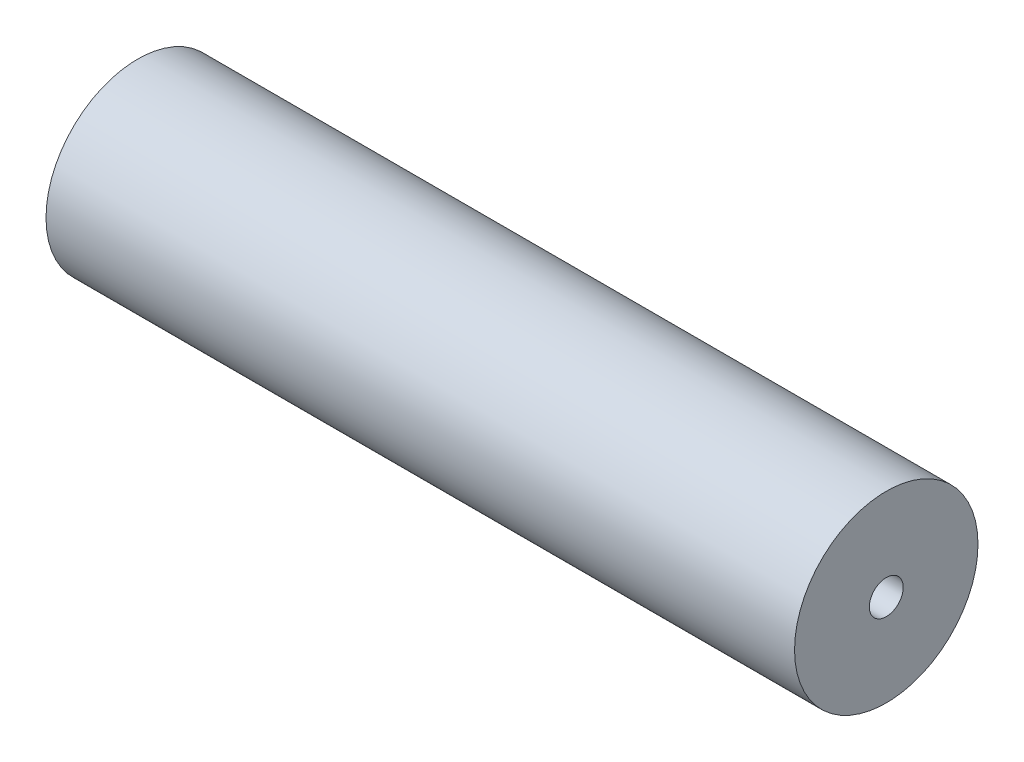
from build123d import *

# Parameters (mm, degrees)
SKETCH1_W                                 = 1549.4
SKETCH1_H                                 = 189.865
SKETCH2_R                                 = 35.052
BORE_TO_MAKE_662_WEIGHTCUT_EXTRUDE1_DEPTH = 1573.494132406


with BuildPart() as part:
    # Sketch1 → Revolve1 (revolve)
    with BuildSketch(Plane.XY, mode=Mode.PRIVATE) as revolve1_sk:
        with Locations((774.7, -94.9325)):
            Rectangle(SKETCH1_W, SKETCH1_H)
    revolve(revolve1_sk.sketch.rotate(Axis((0, 0, 0), (-1, 0, 0)), 270), axis=Axis((0, 0, 0), (-1, 0, 0)))

    # Sketch2 → Bore to make 662 weightCut-Extrude1 (cut, through all)
    with BuildSketch(Plane.ZY):
        Circle(SKETCH2_R)
    extrude(amount=-BORE_TO_MAKE_662_WEIGHTCUT_EXTRUDE1_DEPTH, mode=Mode.SUBTRACT)


solid = part.part
